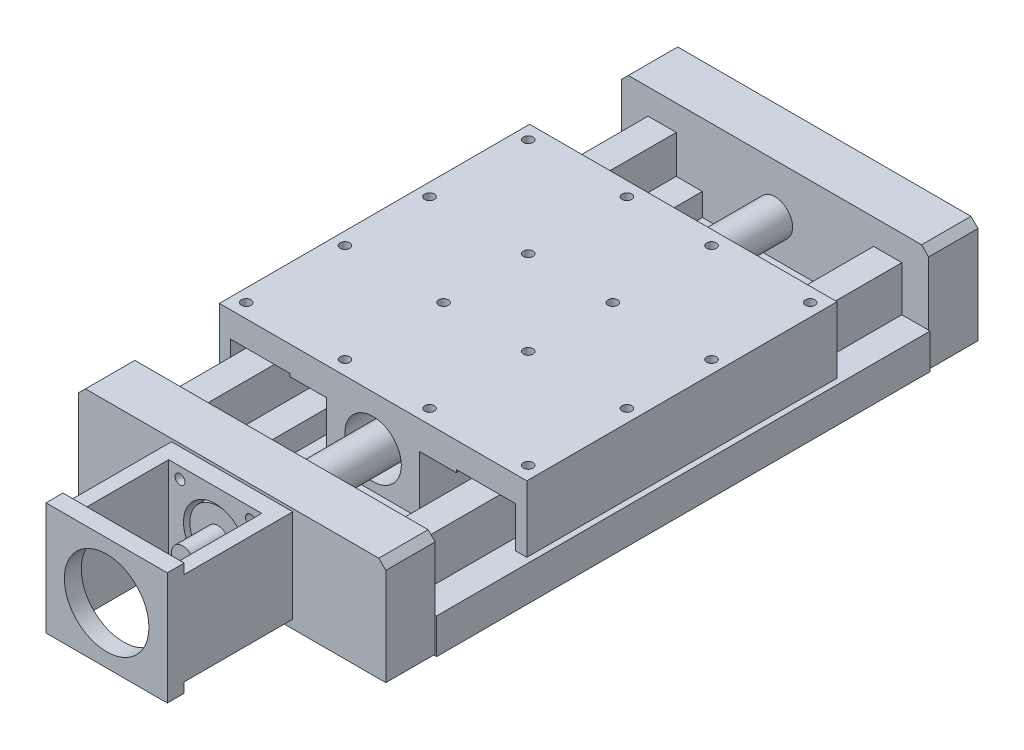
from build123d import *

# Parameters (mm, degrees)
EXTRUDE_1_DEPTH              = 350
SKETCH_2_W                   = 140
SKETCH_2_H                   = 1
CUT_EXTRUDE_1_DEPTH          = 368.227449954
SKETCH_4_W                   = 20
SKETCH_4_H                   = 350
EXTRUDE_2_DEPTH              = 30
EXTRUDE_2_2_DEPTH            = 30
EXTRUDE_3_DEPTH              = 110
SKETCH_6_W                   = 66
SKETCH_6_H                   = 43
EXTRUDE_4_DEPTH              = 100
SKETCH_7_R                   = 15
CUT_EXTRUDE_2_DEPTH          = 312.522069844
SKETCH_8_R                   = 20
CUT_EXTRUDE_3_DEPTH          = 65
SKETCH_9_W                   = 218
SKETCH_9_H                   = 74
EXTRUDE_5_DEPTH              = 35
SKETCH_10_R                  = 12.5
EXTRUDE_6_DEPTH              = 385
SKETCH_12_R                  = 8
EXTRUDE_7_DEPTH              = 35
EXTRUDE_START                = 10
SKETCH_13_R                  = 20
EXTRUDE_8_DEPTH              = 10
CHAMFER_2_SIZE               = 5
CHAMFER_3_SIZE               = 5
SKETCH_16_W                  = 86
SKETCH_16_H                  = 66
SKETCH_16_R                  = 22.5
EXTRUDE_9_DEPTH              = 12
SKETCH_17_W                  = 10
SKETCH_17_H                  = 66
EXTRUDE_10_DEPTH             = 65
SKETCH_18_W                  = 86
SKETCH_18_H                  = 80
SKETCH_18_R                  = 30
EXTRUDE_11_DEPTH             = 12
SKETCH_32_R                  = 3.5
CUT_EXTRUDE_6_DEPTH          = 12
HOLE_WIZARD_M6_2_AT_2_COUNT  = 2
HOLE_WIZARD_M6_2_AT_2_PITCH  = 50
HOLE_WIZARD_M6_2_AT_3_COUNT  = 2
HOLE_WIZARD_M6_2_AT_3_PITCH  = 50
HOLE_WIZARD_M6_2_AT_4_COUNT  = 2
HOLE_WIZARD_M6_2_AT_4_PITCH  = 70.710678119
HOLE_WIZARD_M8_2_AT_2_COUNT  = 2
HOLE_WIZARD_M8_2_AT_2_PITCH  = 200
HOLE_WIZARD_M8_2_AT_3_COUNT  = 2
HOLE_WIZARD_M8_2_AT_3_PITCH  = 130
HOLE_WIZARD_M8_2_AT_4_COUNT  = 2
HOLE_WIZARD_M8_2_AT_4_PITCH  = 147.648230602
HOLE_WIZARD_M8_2_AT_5_COUNT  = 2
HOLE_WIZARD_M8_2_AT_5_PITCH  = 211.896201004
HOLE_WIZARD_M8_2_AT_6_COUNT  = 2
HOLE_WIZARD_M8_2_AT_6_PITCH  = 238.537208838
HOLE_WIZARD_M8_2_AT_7_COUNT  = 2
HOLE_WIZARD_M8_2_AT_7_PITCH  = 183.847763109
HOLE_WIZARD_M8_2_AT_8_COUNT  = 2
HOLE_WIZARD_M8_2_AT_8_PITCH  = 238.537208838
HOLE_WIZARD_M8_2_AT_9_COUNT  = 2
HOLE_WIZARD_M8_2_AT_9_PITCH  = 282.842712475
HOLE_WIZARD_M8_2_AT_10_COUNT = 2
HOLE_WIZARD_M8_2_AT_10_PITCH = 147.648230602
HOLE_WIZARD_M8_2_AT_11_COUNT = 2
HOLE_WIZARD_M8_2_AT_11_PITCH = 130
HOLE_WIZARD_M8_2_AT_12_COUNT = 2
HOLE_WIZARD_M8_2_AT_12_PITCH = 200
HOLE_WIZARD_M8_2_AT_13_COUNT = 2
HOLE_WIZARD_M8_2_AT_13_PITCH = 211.896201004
HOLE_WIZARD_M8_2_AT_14_COUNT = 2
HOLE_WIZARD_M8_2_AT_14_PITCH = 70
HOLE_WIZARD_M8_2_AT_15_COUNT = 2
HOLE_WIZARD_M8_2_AT_15_PITCH = 98.994949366
HOLE_WIZARD_M8_2_AT_16_COUNT = 2
HOLE_WIZARD_M8_2_AT_16_PITCH = 70


with BuildPart() as part:
    # Sketch 1 → Extrude 1 (new body)
    with BuildSketch(Plane.XY):
        Polygon((51.5, 0), (-51.5, 0), (-51.5, 16), (-70, 16), (-70, 13), (-90, 13), (-90, 11), (-110, 11), (-110, -14), (110, -14), (110, 11), (90, 11), (90, 13), (70, 13), (70, 16), (51.5, 16), align=None)
    extrude(amount=EXTRUDE_1_DEPTH)

    # Sketch 2 → Cut-Extrude 1 (cut, through all)
    with BuildSketch(Plane.XY.offset(350)):
        with Locations((0, -13.5)):
            Rectangle(SKETCH_2_W, SKETCH_2_H)
    extrude(amount=-CUT_EXTRUDE_1_DEPTH, mode=Mode.SUBTRACT)



with BuildPart() as body_2:
    # Sketch 4 → Extrude 2 (new body)
    with BuildSketch(Plane(origin=(0, 13, 0), x_dir=(1, 0, 0), z_dir=(0, 1, 0))):
        with Locations((-80, -175)):
            Rectangle(SKETCH_4_W, SKETCH_4_H)
    extrude(amount=EXTRUDE_2_DEPTH)


with BuildPart() as body_3:
    # Sketch 4 → Extrude 2 2 (new body)
    with BuildSketch(Plane(origin=(0, 13, 0), x_dir=(1, 0, 0), z_dir=(0, 1, 0))):
        with Locations((80, -175)):
            Rectangle(SKETCH_4_W, SKETCH_4_H)
    extrude(amount=EXTRUDE_2_2_DEPTH)


with BuildPart() as part_1:
    add(part.part)

    add(body_3.part)  # Extrude 3 merges body 3

    add(body_2.part)  # Extrude 3 merges body 2
    # Sketch 5 → Extrude 3 (add, symmetric)
    with BuildSketch(Plane.XY.offset(175)):
        Polygon((-80, 61), (80, 61), (109, 61), (109, 14), (101, 14), (101, 43), (90, 43), (70, 43), (59, 43), (59, 41), (33, 41), (33, 43), (-33, 43), (-33, 41), (-59, 41), (-59, 43), (-70, 43), (-90, 43), (-101, 43), (-101, 14), (-109, 14), (-109, 61), align=None)
    extrude(amount=EXTRUDE_3_DEPTH, both=True)

    # Sketch 6 → Extrude 4 (add)
    with BuildSketch(Plane.XY.offset(285)):
        with Locations((0, 21.5)):
            Rectangle(SKETCH_6_W, SKETCH_6_H)
    extrude(amount=-EXTRUDE_4_DEPTH)

    # Sketch 7 → Cut-Extrude 2 (cut, through all)
    with BuildSketch(Plane.XY.offset(285)):
        with Locations((0, 26)):
            Circle(SKETCH_7_R)
    extrude(amount=-CUT_EXTRUDE_2_DEPTH, mode=Mode.SUBTRACT)

    # Sketch 8 → Cut-Extrude 3 (cut)
    with BuildSketch(Plane.XY.offset(285)):
        with Locations((0, 26)):
            Circle(SKETCH_8_R)
    extrude(amount=-CUT_EXTRUDE_3_DEPTH, mode=Mode.SUBTRACT)

    # Sketch 36 → Hole Wizard M8 _2 (revolve, cut)
    with BuildSketch(Plane(origin=(-100, 61, 75), x_dir=(0, 0, 1), z_dir=(1, 0, 0))):
        Polygon((0, 0), (0, 24.292926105), (3.4, 22.25), (3.4, 0), align=None)
    hole_wizard_m8_2 = revolve(axis=Axis((-100, 67.35, 75), (0, -1, 0)), mode=Mode.SUBTRACT)

    # Hole Wizard M8 _2 at 2: Hole Wizard M8 _2 ×2
    with Locations(*[(0, 0, i * HOLE_WIZARD_M8_2_AT_2_PITCH) for i in range(1, HOLE_WIZARD_M8_2_AT_2_COUNT)]):
        add(hole_wizard_m8_2, mode=Mode.SUBTRACT)

    # Hole Wizard M8 _2 at 3: Hole Wizard M8 _2 ×2
    with Locations(*[(0, 0, i * HOLE_WIZARD_M8_2_AT_3_PITCH) for i in range(1, HOLE_WIZARD_M8_2_AT_3_COUNT)]):
        add(hole_wizard_m8_2, mode=Mode.SUBTRACT)

    # Hole Wizard M8 _2 at 4: Hole Wizard M8 _2 ×2
    with Locations(*[Vector(0.4740998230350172, 0, 0.8804710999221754) * (i * HOLE_WIZARD_M8_2_AT_4_PITCH) for i in range(1, HOLE_WIZARD_M8_2_AT_4_COUNT)]):
        add(hole_wizard_m8_2, mode=Mode.SUBTRACT)

    # Hole Wizard M8 _2 at 5: Hole Wizard M8 _2 ×2
    with Locations(*[Vector(0.33035042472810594, 0, 0.9438583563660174) * (i * HOLE_WIZARD_M8_2_AT_5_PITCH) for i in range(1, HOLE_WIZARD_M8_2_AT_5_COUNT)]):
        add(hole_wizard_m8_2, mode=Mode.SUBTRACT)

    # Hole Wizard M8 _2 at 6: Hole Wizard M8 _2 ×2
    with Locations(*[Vector(0.5449883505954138, 0, 0.8384436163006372) * (i * HOLE_WIZARD_M8_2_AT_6_PITCH) for i in range(1, HOLE_WIZARD_M8_2_AT_6_COUNT)]):
        add(hole_wizard_m8_2, mode=Mode.SUBTRACT)

    # Hole Wizard M8 _2 at 7: Hole Wizard M8 _2 ×2
    with Locations(*[Vector(0.7071067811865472, 0, 0.7071067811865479) * (i * HOLE_WIZARD_M8_2_AT_7_PITCH) for i in range(1, HOLE_WIZARD_M8_2_AT_7_COUNT)]):
        add(hole_wizard_m8_2, mode=Mode.SUBTRACT)

    # Hole Wizard M8 _2 at 8: Hole Wizard M8 _2 ×2
    with Locations(*[Vector(0.8384436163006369, 0, 0.5449883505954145) * (i * HOLE_WIZARD_M8_2_AT_8_PITCH) for i in range(1, HOLE_WIZARD_M8_2_AT_8_COUNT)]):
        add(hole_wizard_m8_2, mode=Mode.SUBTRACT)

    # Hole Wizard M8 _2 at 9: Hole Wizard M8 _2 ×2
    with Locations(*[Vector(0.7071067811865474, 0, 0.7071067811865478) * (i * HOLE_WIZARD_M8_2_AT_9_PITCH) for i in range(1, HOLE_WIZARD_M8_2_AT_9_COUNT)]):
        add(hole_wizard_m8_2, mode=Mode.SUBTRACT)

    # Hole Wizard M8 _2 at 10: Hole Wizard M8 _2 ×2
    with Locations(*[Vector(0.8804710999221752, 0, 0.47409982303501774) * (i * HOLE_WIZARD_M8_2_AT_10_PITCH) for i in range(1, HOLE_WIZARD_M8_2_AT_10_COUNT)]):
        add(hole_wizard_m8_2, mode=Mode.SUBTRACT)

    # Hole Wizard M8 _2 at 11: Hole Wizard M8 _2 ×2
    with Locations(*[(i * HOLE_WIZARD_M8_2_AT_11_PITCH, 0, 0) for i in range(1, HOLE_WIZARD_M8_2_AT_11_COUNT)]):
        add(hole_wizard_m8_2, mode=Mode.SUBTRACT)

    # Hole Wizard M8 _2 at 12: Hole Wizard M8 _2 ×2
    with Locations(*[(i * HOLE_WIZARD_M8_2_AT_12_PITCH, 0, 0) for i in range(1, HOLE_WIZARD_M8_2_AT_12_COUNT)]):
        add(hole_wizard_m8_2, mode=Mode.SUBTRACT)

    # Hole Wizard M8 _2 at 13: Hole Wizard M8 _2 ×2
    with Locations(*[Vector(0.9438583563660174, 0, 0.3303504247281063) * (i * HOLE_WIZARD_M8_2_AT_13_PITCH) for i in range(1, HOLE_WIZARD_M8_2_AT_13_COUNT)]):
        add(hole_wizard_m8_2, mode=Mode.SUBTRACT)

    # Hole Wizard M8 _2 at 14: Hole Wizard M8 _2 ×2
    with Locations(*[(i * HOLE_WIZARD_M8_2_AT_14_PITCH, 0, 0) for i in range(1, HOLE_WIZARD_M8_2_AT_14_COUNT)]):
        add(hole_wizard_m8_2, mode=Mode.SUBTRACT)

    # Hole Wizard M8 _2 at 15: Hole Wizard M8 _2 ×2
    with Locations(*[Vector(0.7071067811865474, 0, 0.7071067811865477) * (i * HOLE_WIZARD_M8_2_AT_15_PITCH) for i in range(1, HOLE_WIZARD_M8_2_AT_15_COUNT)]):
        add(hole_wizard_m8_2, mode=Mode.SUBTRACT)

    # Hole Wizard M8 _2 at 16: Hole Wizard M8 _2 ×2
    with Locations(*[(0, 0, i * HOLE_WIZARD_M8_2_AT_16_PITCH) for i in range(1, HOLE_WIZARD_M8_2_AT_16_COUNT)]):
        add(hole_wizard_m8_2, mode=Mode.SUBTRACT)


with BuildPart() as body_2_2:
    # Sketch 9 → Extrude 5 (new body)
    with BuildSketch(Plane.XY.offset(350)):
        with Locations((0, 24)):
            Rectangle(SKETCH_9_W, SKETCH_9_H)
    extrude(amount=EXTRUDE_5_DEPTH)


with BuildPart() as body_3_2:
    # Mirror 1: mirrored copy
    add(body_2_2.part.mirror(Plane.XY.offset(175)))

    # Chamfer 2
    chamfer_2_edges = [body_3_2.edges().sort_by_distance(p)[0] for p in [
        (-109, 61, -17.5),
        (109, 61, -17.5),
    ]]
    chamfer(chamfer_2_edges, length=CHAMFER_2_SIZE)


with BuildPart() as body_4:
    # Sketch 10 → Extrude 6 (new body)
    with BuildSketch(Plane.XY):
        with Locations(Location((0, 26, 0), (0, 0, 180))):
            Circle(SKETCH_10_R)
    extrude(amount=EXTRUDE_6_DEPTH)


with BuildPart() as body_2_2_1:
    add(body_2_2.part)

    add(body_4.part)  # Extrude 7 merges body 4
    # Sketch 12 → Extrude 7 (add)
    with BuildSketch(Plane.XY.offset(385)):
        with Locations((0, 26)):
            Circle(SKETCH_12_R)
    extrude(amount=EXTRUDE_7_DEPTH)

    # Sketch 13 → Extrude 8 (add)
    with BuildSketch(Plane.XY.offset(385).offset(EXTRUDE_START)):
        with Locations((0, 26)):
            Circle(SKETCH_13_R)
    extrude(amount=-EXTRUDE_8_DEPTH)

    # Chamfer 3
    chamfer_3_edges = [body_2_2_1.edges().sort_by_distance(p)[0] for p in [
        (-109, 61, 367.5),
        (109, 61, 367.5),
    ]]
    chamfer(chamfer_3_edges, length=CHAMFER_3_SIZE)

    # Sketch 16 → Extrude 9 (add)
    with BuildSketch(Plane.XY.offset(385)):
        with Locations((0, 26)):
            Rectangle(SKETCH_16_W, SKETCH_16_H)
        with Locations((0, 26)):
            Circle(SKETCH_16_R, mode=Mode.SUBTRACT)
    extrude(amount=EXTRUDE_9_DEPTH)

    # Sketch 17 → Extrude 10 (add)
    with BuildSketch(Plane.XY.offset(397)):
        with Locations((-38, 26)):
            Rectangle(SKETCH_17_W, SKETCH_17_H)
        with Locations((38, 26)):
            Rectangle(SKETCH_17_W, SKETCH_17_H)
    extrude(amount=EXTRUDE_10_DEPTH)

    # Sketch 18 → Extrude 11 (add)
    with BuildSketch(Plane.XY.offset(462)):
        with Locations((0, 26)):
            Rectangle(SKETCH_18_W, SKETCH_18_H)
        with Locations((0, 26)):
            Circle(SKETCH_18_R, mode=Mode.SUBTRACT)
    extrude(amount=EXTRUDE_11_DEPTH)

    # Sketch 32 → Cut-Extrude 6 (cut)
    with BuildSketch(Plane.XY.offset(397)):
        with Locations((-25, 51)):
            Circle(SKETCH_32_R)
        with Locations((25, 51)):
            Circle(SKETCH_32_R)
        with Locations((25, 1)):
            Circle(SKETCH_32_R)
        with Locations((-25, 1)):
            Circle(SKETCH_32_R)
    extrude(amount=-CUT_EXTRUDE_6_DEPTH, mode=Mode.SUBTRACT)

    # Sketch 33 → Hole Wizard M6 _2 (revolve, cut)
    with BuildSketch(Plane(origin=(-25, 51, 397), x_dir=(0, -1, 0), z_dir=(1, 0, 0))):
        Polygon((0, 0), (0, 16.502151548), (2.5, 15), (2.5, 0), align=None)
    hole_wizard_m6_2 = revolve(axis=Axis((-25, 51, 403.35), (0, 0, -1)), mode=Mode.SUBTRACT)

    # Hole Wizard M6 _2 at 2: Hole Wizard M6 _2 ×2
    with Locations(*[(i * HOLE_WIZARD_M6_2_AT_2_PITCH, 0, 0) for i in range(1, HOLE_WIZARD_M6_2_AT_2_COUNT)]):
        add(hole_wizard_m6_2, mode=Mode.SUBTRACT)

    # Hole Wizard M6 _2 at 3: Hole Wizard M6 _2 ×2
    with Locations(*[(0, -i * HOLE_WIZARD_M6_2_AT_3_PITCH, 0) for i in range(1, HOLE_WIZARD_M6_2_AT_3_COUNT)]):
        add(hole_wizard_m6_2, mode=Mode.SUBTRACT)

    # Hole Wizard M6 _2 at 4: Hole Wizard M6 _2 ×2
    with Locations(*[Vector(0.7071067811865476, -0.7071067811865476, 0) * (i * HOLE_WIZARD_M6_2_AT_4_PITCH) for i in range(1, HOLE_WIZARD_M6_2_AT_4_COUNT)]):
        add(hole_wizard_m6_2, mode=Mode.SUBTRACT)


solid = Compound([part_1.part, body_3_2.part, body_2_2_1.part])
